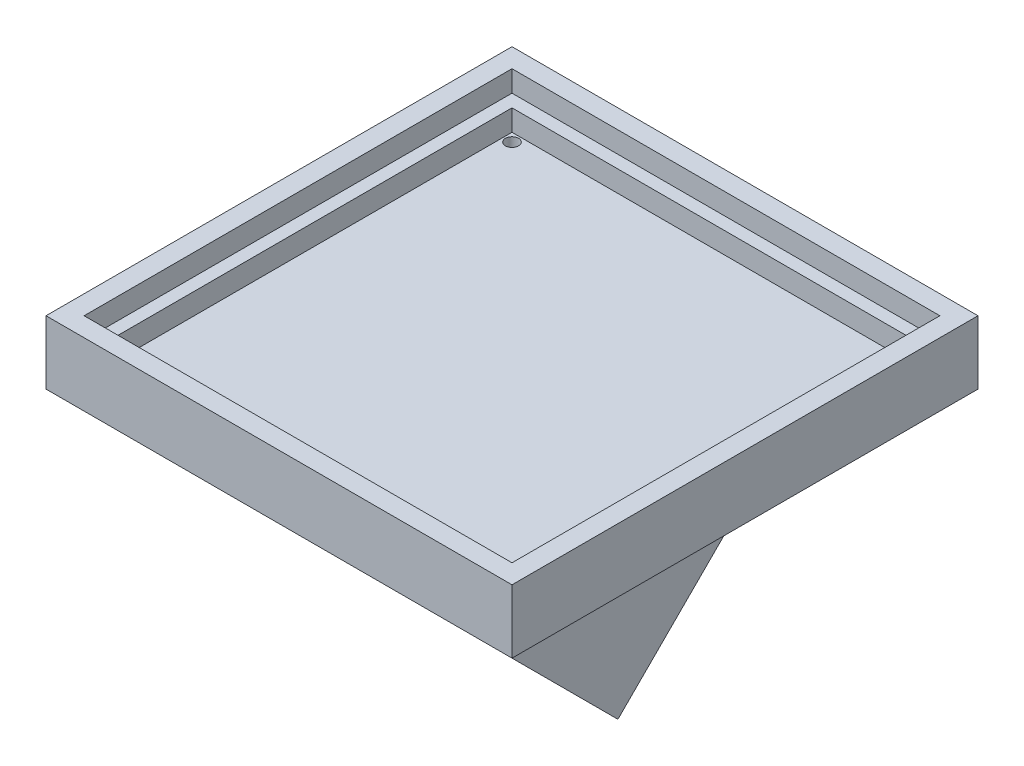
from build123d import *

# Parameters (mm, degrees)
SKETCH1_W           = 110
SKETCH1_H           = 110
BOSS_EXTRUDE1_DEPTH = 7.5
SKETCH2_W           = 101
SKETCH2_H           = 101
CUT_EXTRUDE1_DEPTH  = 5
SKETCH3_R           = 1.55
CUT_EXTRUDE2_DEPTH  = 79.421935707
SKETCH4_W           = 95
SKETCH4_H           = 95
CUT_EXTRUDE3_DEPTH  = 5
CUT_EXTRUDE4_DEPTH  = 2.3
BOSS_EXTRUDE2_DEPTH = 25


with BuildPart() as part:
    # Sketch1 → Boss-Extrude1 (new, symmetric)
    with BuildSketch(Plane(origin=(0, 0, 0), x_dir=(1, 0, 0), z_dir=(0, 1, 0))):
        Rectangle(SKETCH1_W, SKETCH1_H)
    extrude(amount=BOSS_EXTRUDE1_DEPTH, both=True)

    # Sketch2 → Cut-Extrude1 (cut)
    with BuildSketch(Plane(origin=(0, 7.5, 0), x_dir=(1, 0, 0), z_dir=(0, 1, 0))):
        Rectangle(SKETCH2_W, SKETCH2_H)
    extrude(amount=-CUT_EXTRUDE1_DEPTH, mode=Mode.SUBTRACT)

    # Sketch3 → Cut-Extrude2 (cut, through all)
    with BuildSketch(Plane(origin=(0, 2.5, 0), x_dir=(1, 0, 0), z_dir=(0, 1, 0))):
        with Locations(Location((-45.5, 45.5, 0), (0, 0, 270))):
            Circle(SKETCH3_R)
        with Locations(Location((45.55, 44.91, 0), (0, 0, 270))):
            Circle(SKETCH3_R)
        with Locations(Location((45.5, -45.26, 0), (0, 0, 270))):
            Circle(SKETCH3_R)
        with Locations(Location((-45.47, -45.09, 0), (0, 0, 270))):
            Circle(SKETCH3_R)
    extrude(amount=-CUT_EXTRUDE2_DEPTH, mode=Mode.SUBTRACT)

    # Sketch4 → Cut-Extrude3 (cut)
    with BuildSketch(Plane(origin=(0, 2.5, 0), x_dir=(1, 0, 0), z_dir=(0, 1, 0))):
        Rectangle(SKETCH4_W, SKETCH4_H)
    extrude(amount=-CUT_EXTRUDE3_DEPTH, mode=Mode.SUBTRACT)

    # Sketch5 → Cut-Extrude4 (cut)
    with BuildSketch(Plane.XZ.offset(7.5)):
        Polygon((-47.149039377, 47.953854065), (-48.789690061, 45.067836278), (-47.110650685, 42.203982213), (-43.790960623, 42.226145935), (-42.150309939, 45.112163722), (-43.829349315, 47.976017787), align=None)
        Polygon((47.179804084, 48.12340559), (43.860120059, 48.146455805), (42.180315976, 45.283050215), (43.820195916, 42.39659441), (47.139879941, 42.373544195), (48.819684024, 45.236949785), align=None)
        Polygon((-48.684667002, -46.437405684), (-46.280516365, -48.726705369), (-43.095849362, -47.789299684), (-42.315332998, -44.562594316), (-44.719483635, -42.273294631), (-47.904150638, -43.210700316), align=None)
        Polygon((48.733947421, -45.849846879), (47.955904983, -42.622544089), (44.771957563, -41.68269721), (42.366052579, -43.970153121), (43.144095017, -47.197455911), (46.328042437, -48.13730279), align=None)
    extrude(amount=-CUT_EXTRUDE4_DEPTH, mode=Mode.SUBTRACT)

    # Sketch6 → Boss-Extrude2 (add, symmetric)
    with BuildSketch(Plane(origin=(0, 0, 0), x_dir=(0, 0, -1), z_dir=(1, 0, 0))):
        Polygon((0, -62.5), (-55, -7.5), (55, -7.5), align=None)
    extrude(amount=BOSS_EXTRUDE2_DEPTH, both=True)


solid = part.part
